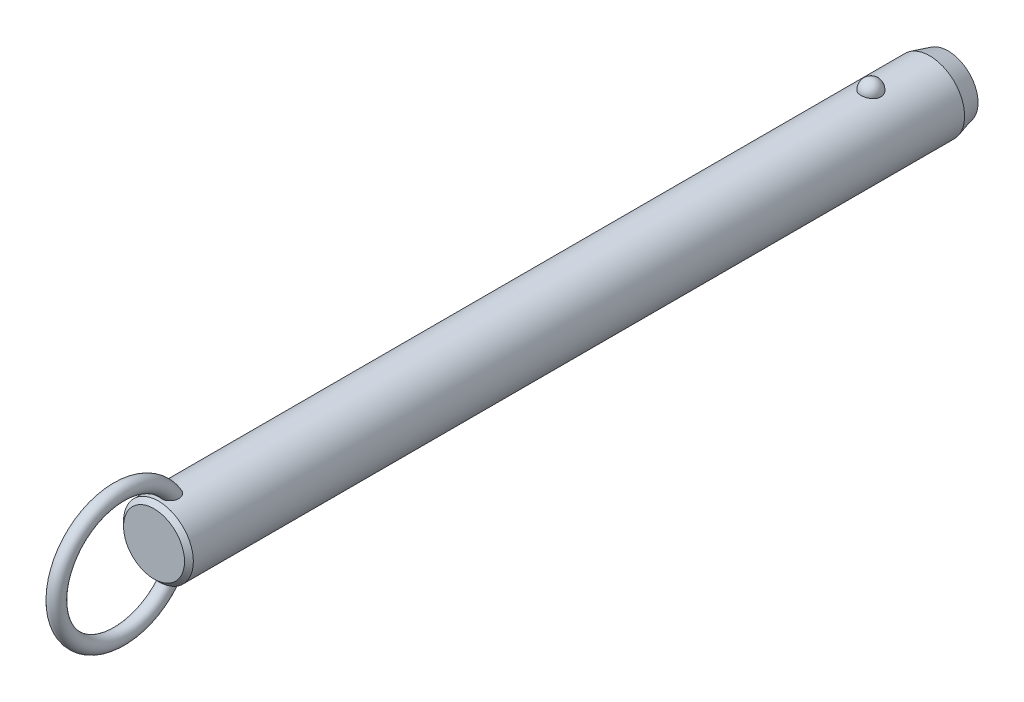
ISO-10303-21;
HEADER;
FILE_DESCRIPTION(('STEP AP214'),'2;1');
FILE_NAME('part.step','',(''),(''),'','','');
FILE_SCHEMA(('AUTOMOTIVE_DESIGN { 1 0 10303 214 1 1 1 1 }'));
ENDSEC;
DATA;
#1=APPLICATION_CONTEXT('core data for automotive mechanical design processes');
#2=APPLICATION_PROTOCOL_DEFINITION('international standard','automotive_design',2000,#1);
#3=PRODUCT_CONTEXT('',#1,'mechanical');
#4=PRODUCT('Part','Part','',(#3));
#5=PRODUCT_RELATED_PRODUCT_CATEGORY('part','',(#4));
#6=PRODUCT_DEFINITION_FORMATION('','',#4);
#7=PRODUCT_DEFINITION_CONTEXT('part definition',#1,'design');
#8=PRODUCT_DEFINITION('design','',#6,#7);
#9=PRODUCT_DEFINITION_SHAPE('','',#8);
#10=(LENGTH_UNIT() NAMED_UNIT(*) SI_UNIT(.MILLI.,.METRE.));
#11=(NAMED_UNIT(*) PLANE_ANGLE_UNIT() SI_UNIT($,.RADIAN.));
#12=(NAMED_UNIT(*) SI_UNIT($,.STERADIAN.) SOLID_ANGLE_UNIT());
#13=UNCERTAINTY_MEASURE_WITH_UNIT(LENGTH_MEASURE(1.E-05),#10,'distance_accuracy_value','');
#14=(GEOMETRIC_REPRESENTATION_CONTEXT(3) GLOBAL_UNCERTAINTY_ASSIGNED_CONTEXT((#13)) GLOBAL_UNIT_ASSIGNED_CONTEXT((#10,
#11,#12)) REPRESENTATION_CONTEXT('',''));
#15=CARTESIAN_POINT('',(0.,0.,0.));
#16=DIRECTION('',(0.,0.,1.));
#17=DIRECTION('',(1.,0.,0.));
#18=AXIS2_PLACEMENT_3D('',#15,#16,#17);
#19=CARTESIAN_POINT('',(0.,0.,182.9));
#20=DIRECTION('',(0.,0.,-1.));
#21=DIRECTION('',(-1.,0.,0.));
#22=AXIS2_PLACEMENT_3D('',#19,#20,#21);
#23=CYLINDRICAL_SURFACE('',#22,9.5);
#24=CARTESIAN_POINT('',(2.67259918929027,9.11631578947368,-2.70000000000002));
#25=CARTESIAN_POINT('',(2.6725968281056,9.11631786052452,-2.54909854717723));
#26=CARTESIAN_POINT('',(2.66030567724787,9.11994722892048,-2.39816735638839));
#27=CARTESIAN_POINT('',(2.6114347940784,9.13405924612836,-2.10058568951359));
#28=CARTESIAN_POINT('',(2.57484658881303,9.14454428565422,-1.95393672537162));
#29=CARTESIAN_POINT('',(2.47830875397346,9.17117631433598,-1.66916069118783));
#30=CARTESIAN_POINT('',(2.41836936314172,9.18732082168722,-1.53102991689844));
#31=CARTESIAN_POINT('',(2.27661331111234,9.22346780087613,-1.26705393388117));
#32=CARTESIAN_POINT('',(2.19479699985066,9.24347021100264,-1.14120852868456));
#33=CARTESIAN_POINT('',(2.01085282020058,9.28522401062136,-0.904632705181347));
#34=CARTESIAN_POINT('',(1.90862396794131,9.30698376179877,-0.793982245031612));
#35=CARTESIAN_POINT('',(1.6867437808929,9.34973971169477,-0.591607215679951));
#36=CARTESIAN_POINT('',(1.56709244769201,9.37073591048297,-0.499882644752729));
#37=CARTESIAN_POINT('',(1.31393976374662,9.40956370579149,-0.33816762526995));
#38=CARTESIAN_POINT('',(1.18048026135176,9.42740444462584,-0.268113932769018));
#39=CARTESIAN_POINT('',(0.903154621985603,9.45799906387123,-0.151390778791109));
#40=CARTESIAN_POINT('',(0.759289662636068,9.47075351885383,-0.104718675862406));
#41=CARTESIAN_POINT('',(0.468074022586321,9.48956256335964,-0.0367633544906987));
#42=CARTESIAN_POINT('',(0.320836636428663,9.49573643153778,-0.015027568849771));
#43=CARTESIAN_POINT('',(0.0246714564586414,9.50112183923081,0.0039619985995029));
#44=CARTESIAN_POINT('',(-0.124256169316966,9.50033406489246,0.00121819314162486));
#45=CARTESIAN_POINT('',(-0.417264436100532,9.4919475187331,-0.0284441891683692));
#46=CARTESIAN_POINT('',(-0.56138413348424,9.48444885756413,-0.0550074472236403));
#47=CARTESIAN_POINT('',(-0.842986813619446,9.46357853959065,-0.131064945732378));
#48=CARTESIAN_POINT('',(-0.980469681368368,9.450206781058,-0.180559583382));
#49=CARTESIAN_POINT('',(-1.24585005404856,9.41890822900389,-0.301476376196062));
#50=CARTESIAN_POINT('',(-1.37368611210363,9.40095498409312,-0.373026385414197));
#51=CARTESIAN_POINT('',(-1.61552738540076,9.3624296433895,-0.53602540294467));
#52=CARTESIAN_POINT('',(-1.72953116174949,9.34185727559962,-0.62747647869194));
#53=CARTESIAN_POINT('',(-1.9429225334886,9.29984568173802,-0.829844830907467));
#54=CARTESIAN_POINT('',(-2.04198021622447,9.27839736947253,-0.941108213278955));
#55=CARTESIAN_POINT('',(-2.2202646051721,9.23735994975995,-1.17883414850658));
#56=CARTESIAN_POINT('',(-2.29948985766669,9.21777097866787,-1.30529781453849));
#57=CARTESIAN_POINT('',(-2.43697287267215,9.18238994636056,-1.57158566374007));
#58=CARTESIAN_POINT('',(-2.49497068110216,9.16664569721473,-1.71155057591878));
#59=CARTESIAN_POINT('',(-2.5872073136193,9.14104303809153,-1.99961197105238));
#60=CARTESIAN_POINT('',(-2.62144683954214,9.13118445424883,-2.1477082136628));
#61=CARTESIAN_POINT('',(-2.66521466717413,9.11850622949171,-2.44715424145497));
#62=CARTESIAN_POINT('',(-2.67484831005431,9.11565658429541,-2.59848735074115));
#63=CARTESIAN_POINT('',(-2.66946735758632,9.11723375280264,-2.90067317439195));
#64=CARTESIAN_POINT('',(-2.65445345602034,9.12166036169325,-3.05152590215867));
#65=CARTESIAN_POINT('',(-2.6002971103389,9.13724422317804,-3.34766110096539));
#66=CARTESIAN_POINT('',(-2.56127978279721,9.14836656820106,-3.49296833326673));
#67=CARTESIAN_POINT('',(-2.46018844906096,9.17606676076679,-3.77477535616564));
#68=CARTESIAN_POINT('',(-2.39811349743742,9.19264483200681,-3.91127478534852));
#69=CARTESIAN_POINT('',(-2.25202303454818,9.22952198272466,-4.17244273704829));
#70=CARTESIAN_POINT('',(-2.16788714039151,9.24984129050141,-4.29704106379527));
#71=CARTESIAN_POINT('',(-1.9799408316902,9.29188255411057,-4.53013066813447));
#72=CARTESIAN_POINT('',(-1.87612963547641,9.31360456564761,-4.63862130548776));
#73=CARTESIAN_POINT('',(-1.65105429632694,9.35612959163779,-4.83690299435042));
#74=CARTESIAN_POINT('',(-1.52972405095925,9.37692871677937,-4.9266199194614));
#75=CARTESIAN_POINT('',(-1.27318250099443,9.41518970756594,-5.08429106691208));
#76=CARTESIAN_POINT('',(-1.13797219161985,9.432651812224,-5.15224684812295));
#77=CARTESIAN_POINT('',(-0.859280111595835,9.46208255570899,-5.26371827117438));
#78=CARTESIAN_POINT('',(-0.715925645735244,9.47411833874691,-5.30753421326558));
#79=CARTESIAN_POINT('',(-0.423550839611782,9.4916822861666,-5.37076321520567));
#80=CARTESIAN_POINT('',(-0.2745312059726,9.49721125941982,-5.39017930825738));
#81=CARTESIAN_POINT('',(0.0218446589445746,9.50110860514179,-5.40390587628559));
#82=CARTESIAN_POINT('',(0.16917707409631,9.49961381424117,-5.39869609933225));
#83=CARTESIAN_POINT('',(0.460808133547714,9.48993906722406,-5.36441955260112));
#84=CARTESIAN_POINT('',(0.605106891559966,9.48175936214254,-5.33535367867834));
#85=CARTESIAN_POINT('',(0.886027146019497,9.4596376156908,-5.25435587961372));
#86=CARTESIAN_POINT('',(1.02267710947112,9.44571881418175,-5.20251612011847));
#87=CARTESIAN_POINT('',(1.28523827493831,9.41358993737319,-5.07741549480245));
#88=CARTESIAN_POINT('',(1.41114877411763,9.39537958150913,-5.00415322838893));
#89=CARTESIAN_POINT('',(1.65085227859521,9.3562644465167,-4.83684599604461));
#90=CARTESIAN_POINT('',(1.76442346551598,9.33532178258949,-4.74249218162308));
#91=CARTESIAN_POINT('',(1.97425672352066,9.29321198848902,-4.53620389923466));
#92=CARTESIAN_POINT('',(2.07051582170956,9.27204482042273,-4.42426641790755));
#93=CARTESIAN_POINT('',(2.24490086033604,9.23139221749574,-4.18363183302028));
#94=CARTESIAN_POINT('',(2.32267019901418,9.21194380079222,-4.05466990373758));
#95=CARTESIAN_POINT('',(2.45584092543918,9.1773419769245,-3.78517836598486));
#96=CARTESIAN_POINT('',(2.51124979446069,9.16218713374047,-3.644652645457));
#97=CARTESIAN_POINT('',(2.59380876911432,9.13913522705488,-3.37104301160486));
#98=CARTESIAN_POINT('',(2.62330266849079,9.13064624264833,-3.23871053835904));
#99=CARTESIAN_POINT('',(2.66269870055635,9.11923566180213,-2.97092664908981));
#100=CARTESIAN_POINT('',(2.67260130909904,9.11631393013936,-2.83547530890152));
#101=CARTESIAN_POINT('',(2.67259918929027,9.11631578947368,-2.70000000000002));
#102=B_SPLINE_CURVE_WITH_KNOTS('',3,(#24,#25,#26,#27,#28,#29,#30,#31,#32,#33,#34,#35,#36,#37,
#38,#39,#40,#41,#42,#43,#44,#45,#46,#47,#48,#49,#50,#51,#52,#53,#54,#55,#56,#57,#58,#59,#60,#61,
#62,#63,#64,#65,#66,#67,#68,#69,#70,#71,#72,#73,#74,#75,#76,#77,#78,#79,#80,#81,#82,#83,#84,#85,
#86,#87,#88,#89,#90,#91,#92,#93,#94,#95,#96,#97,#98,#99,#100,#101),.UNSPECIFIED.,.T.,.F.,(4,2,2,
2,2,2,2,2,2,2,2,2,2,2,2,2,2,2,2,2,2,2,2,2,2,2,2,2,2,2,2,2,2,2,2,2,2,2,4),(0.,0.452217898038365,
0.904593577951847,1.35677112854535,1.80894144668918,2.26340676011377,2.71787203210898,
3.17099820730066,3.62407318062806,4.0687883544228,4.51345969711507,4.95160616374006,
5.38976021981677,5.83050358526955,6.27129275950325,6.72071308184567,7.17016633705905,
7.62495278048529,8.07972578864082,8.53254856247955,8.98535859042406,9.43582813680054,
9.88631615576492,10.3393155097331,10.7923328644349,11.2471065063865,11.7018475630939,
12.150795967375,12.5996885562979,13.0398725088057,13.4800399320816,13.9184421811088,
14.3568730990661,14.802202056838,15.2476074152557,15.7010097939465,16.1542603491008,
16.5602594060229,16.9662486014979),.UNSPECIFIED.);
#103=CARTESIAN_POINT('',(2.67259918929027,9.11631578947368,-2.70000000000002));
#104=VERTEX_POINT('',#103);
#105=EDGE_CURVE('E41',#104,#104,#102,.T.);
#106=ORIENTED_EDGE('',*,*,#105,.T.);
#107=EDGE_LOOP('',(#106));
#108=FACE_BOUND('',#107,.T.);
#109=CARTESIAN_POINT('',(0.,0.,191.22));
#110=DIRECTION('',(0.,0.,1.));
#111=DIRECTION('',(1.,0.,0.));
#112=AXIS2_PLACEMENT_3D('',#109,#110,#111);
#113=CIRCLE('',#112,9.5);
#114=CARTESIAN_POINT('',(9.5,0.,191.22));
#115=VERTEX_POINT('',#114);
#116=EDGE_CURVE('E10',#115,#115,#113,.F.);
#117=ORIENTED_EDGE('',*,*,#116,.T.);
#118=EDGE_LOOP('',(#117));
#119=FACE_BOUND('',#118,.T.);
#120=CARTESIAN_POINT('',(-0.697062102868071,-9.47439269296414,185.567808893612));
#121=CARTESIAN_POINT('',(-0.799579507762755,-9.46685146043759,185.607482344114));
#122=CARTESIAN_POINT('',(-0.898575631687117,-9.45788043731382,185.6559309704));
#123=CARTESIAN_POINT('',(-1.08670047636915,-9.43811593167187,185.768868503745));
#124=CARTESIAN_POINT('',(-1.17583204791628,-9.42732297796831,185.833352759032));
#125=CARTESIAN_POINT('',(-1.34179806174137,-9.40513672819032,185.976209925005));
#126=CARTESIAN_POINT('',(-1.41865133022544,-9.39374438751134,186.054561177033));
#127=CARTESIAN_POINT('',(-1.55860047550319,-9.37154196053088,186.222752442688));
#128=CARTESIAN_POINT('',(-1.62169476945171,-9.3607319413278,186.31259377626));
#129=CARTESIAN_POINT('',(-1.73527695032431,-9.34035749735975,186.504500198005));
#130=CARTESIAN_POINT('',(-1.78522266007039,-9.33085270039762,186.606891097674));
#131=CARTESIAN_POINT('',(-1.86924997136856,-9.3143834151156,186.818148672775));
#132=CARTESIAN_POINT('',(-1.90332570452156,-9.30741986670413,186.927017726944));
#133=CARTESIAN_POINT('',(-1.95893603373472,-9.29588482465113,187.160473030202));
#134=CARTESIAN_POINT('',(-1.97872420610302,-9.29165182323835,187.285489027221));
#135=CARTESIAN_POINT('',(-2.00062129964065,-9.28695978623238,187.537080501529));
#136=CARTESIAN_POINT('',(-2.00272284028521,-9.28650232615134,187.663656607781));
#137=CARTESIAN_POINT('',(-1.98958876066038,-9.28932750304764,187.936815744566));
#138=CARTESIAN_POINT('',(-1.97143366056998,-9.2932400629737,188.083251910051));
#139=CARTESIAN_POINT('',(-1.91479925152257,-9.30507151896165,188.372062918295));
#140=CARTESIAN_POINT('',(-1.87629122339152,-9.31299607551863,188.514431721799));
#141=CARTESIAN_POINT('',(-1.77225683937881,-9.33340232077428,188.815172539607));
#142=CARTESIAN_POINT('',(-1.70334898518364,-9.34641636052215,188.972369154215));
#143=CARTESIAN_POINT('',(-1.58111062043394,-9.36759153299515,189.197517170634));
#144=CARTESIAN_POINT('',(-1.53721459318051,-9.37492619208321,189.270796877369));
#145=CARTESIAN_POINT('',(-1.4430263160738,-9.38988566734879,189.41307405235));
#146=CARTESIAN_POINT('',(-1.39273721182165,-9.39751033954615,189.482073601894));
#147=CARTESIAN_POINT('',(-1.26775962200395,-9.41530678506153,189.636983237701));
#148=CARTESIAN_POINT('',(-1.19052326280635,-9.42548108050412,189.720871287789));
#149=CARTESIAN_POINT('',(-1.02420241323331,-9.44499825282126,189.876008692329));
#150=CARTESIAN_POINT('',(-0.93513986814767,-9.45434261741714,189.947280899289));
#151=CARTESIAN_POINT('',(-0.766610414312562,-9.46930670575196,190.058695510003));
#152=CARTESIAN_POINT('',(-0.689439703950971,-9.47529223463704,190.102235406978));
#153=CARTESIAN_POINT('',(-0.528942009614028,-9.48560294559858,190.17631336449));
#154=CARTESIAN_POINT('',(-0.445620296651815,-9.48992953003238,190.206862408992));
#155=CARTESIAN_POINT('',(-0.273901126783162,-9.49644161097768,190.252579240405));
#156=CARTESIAN_POINT('',(-0.18546574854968,-9.49860811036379,190.26761059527));
#157=CARTESIAN_POINT('',(-0.00734541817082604,-9.5004135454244,190.280149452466));
#158=CARTESIAN_POINT('',(0.0823387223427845,-9.50005405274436,190.277667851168));
#159=CARTESIAN_POINT('',(0.24767927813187,-9.49708301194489,190.256995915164));
#160=CARTESIAN_POINT('',(0.323620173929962,-9.49477609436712,190.240930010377));
#161=CARTESIAN_POINT('',(0.471981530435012,-9.48855917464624,190.197172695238));
#162=CARTESIAN_POINT('',(0.544400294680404,-9.48464840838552,190.169475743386));
#163=CARTESIAN_POINT('',(0.708947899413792,-9.47398336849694,190.09280266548));
#164=CARTESIAN_POINT('',(0.799149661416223,-9.46671310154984,190.039774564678));
#165=CARTESIAN_POINT('',(0.969783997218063,-9.45076225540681,189.919973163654));
#166=CARTESIAN_POINT('',(1.050194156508,-9.44207854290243,189.853169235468));
#167=CARTESIAN_POINT('',(1.2309234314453,-9.42051459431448,189.680759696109));
#168=CARTESIAN_POINT('',(1.32652499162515,-9.40733378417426,189.57026193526));
#169=CARTESIAN_POINT('',(1.49893121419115,-9.38140745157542,189.335561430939));
#170=CARTESIAN_POINT('',(1.5757161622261,-9.36866239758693,189.211344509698));
#171=CARTESIAN_POINT('',(1.71285426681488,-9.34457644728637,188.949389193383));
#172=CARTESIAN_POINT('',(1.77266365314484,-9.33328726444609,188.81136233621));
#173=CARTESIAN_POINT('',(1.87239208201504,-9.31379209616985,188.528051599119));
#174=CARTESIAN_POINT('',(1.91230158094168,-9.3055875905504,188.382764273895));
#175=CARTESIAN_POINT('',(1.97604189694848,-9.29228394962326,188.062028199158));
#176=CARTESIAN_POINT('',(1.9958743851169,-9.28797202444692,187.885724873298));
#177=CARTESIAN_POINT('',(2.0029570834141,-9.28645519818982,187.532414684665));
#178=CARTESIAN_POINT('',(1.99025930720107,-9.28923895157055,187.355409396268));
#179=CARTESIAN_POINT('',(1.93735479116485,-9.30038134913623,187.056338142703));
#180=CARTESIAN_POINT('',(1.90576827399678,-9.30697680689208,186.932667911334));
#181=CARTESIAN_POINT('',(1.8228748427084,-9.32356855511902,186.692329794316));
#182=CARTESIAN_POINT('',(1.77158213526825,-9.33356239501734,186.575656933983));
#183=CARTESIAN_POINT('',(1.64885744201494,-9.35602275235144,186.352706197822));
#184=CARTESIAN_POINT('',(1.57730995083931,-9.36850332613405,186.246492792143));
#185=CARTESIAN_POINT('',(1.41543264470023,-9.39431873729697,186.049553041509));
#186=CARTESIAN_POINT('',(1.32510883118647,-9.40765330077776,185.958821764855));
#187=CARTESIAN_POINT('',(1.13846223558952,-9.43195720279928,185.805033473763));
#188=CARTESIAN_POINT('',(1.04369890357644,-9.44302894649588,185.740094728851));
#189=CARTESIAN_POINT('',(0.843965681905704,-9.46296805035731,185.628038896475));
#190=CARTESIAN_POINT('',(0.739000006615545,-9.47183631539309,185.580914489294));
#191=CARTESIAN_POINT('',(0.528175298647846,-9.48586140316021,185.508117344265));
#192=CARTESIAN_POINT('',(0.422686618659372,-9.49119633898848,185.48140249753));
#193=CARTESIAN_POINT('',(0.208590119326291,-9.49831365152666,185.446013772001));
#194=CARTESIAN_POINT('',(0.0999817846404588,-9.500095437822,185.437342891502));
#195=CARTESIAN_POINT('',(-0.126104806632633,-9.49988861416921,185.438350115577));
#196=CARTESIAN_POINT('',(-0.243578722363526,-9.49757821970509,185.449594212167));
#197=CARTESIAN_POINT('',(-0.474390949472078,-9.48885165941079,185.493167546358));
#198=CARTESIAN_POINT('',(-0.587729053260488,-9.48243528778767,185.525497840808));
#199=CARTESIAN_POINT('',(-0.697062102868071,-9.47439269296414,185.567808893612));
#200=B_SPLINE_CURVE_WITH_KNOTS('',3,(#120,#121,#122,#123,#124,#125,#126,#127,#128,#129,#130,
#131,#132,#133,#134,#135,#136,#137,#138,#139,#140,#141,#142,#143,#144,#145,#146,#147,#148,#149,
#150,#151,#152,#153,#154,#155,#156,#157,#158,#159,#160,#161,#162,#163,#164,#165,#166,#167,#168,
#169,#170,#171,#172,#173,#174,#175,#176,#177,#178,#179,#180,#181,#182,#183,#184,#185,#186,#187,
#188,#189,#190,#191,#192,#193,#194,#195,#196,#197,#198,#199),.UNSPECIFIED.,.T.,.F.,(4,2,2,2,2,2,
2,2,2,2,2,2,2,2,2,2,2,2,2,2,2,2,2,2,2,2,2,2,2,2,2,2,2,2,2,2,2,2,2,4),(0.,0.330119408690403,
0.660143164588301,0.989655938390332,1.31920659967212,1.66074728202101,2.00241415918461,
2.38088696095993,2.75951768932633,3.20065679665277,3.64242004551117,4.15620996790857,
4.4131416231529,4.66994734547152,5.01228664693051,5.35399933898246,5.61943037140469,
5.88463652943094,6.15215502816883,6.4195070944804,6.65144391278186,6.88349136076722,
7.19641200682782,7.51003602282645,7.94779711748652,8.3860149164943,8.83699707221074,
9.28819530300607,9.81778662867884,10.34653170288,10.7284172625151,11.1100280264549,
11.4938603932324,11.8775702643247,12.2220189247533,12.5663259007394,12.8915939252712,
13.2169159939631,13.5689650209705,13.9210316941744),.UNSPECIFIED.);
#201=CARTESIAN_POINT('',(-0.697062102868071,-9.47439269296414,185.567808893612));
#202=VERTEX_POINT('',#201);
#203=EDGE_CURVE('E59',#202,#202,#200,.T.);
#204=ORIENTED_EDGE('',*,*,#203,.T.);
#205=EDGE_LOOP('',(#204));
#206=FACE_BOUND('',#205,.T.);
#207=CARTESIAN_POINT('',(-0.697062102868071,9.47439269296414,185.567808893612));
#208=CARTESIAN_POINT('',(-0.597792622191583,9.48169483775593,185.52939564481));
#209=CARTESIAN_POINT('',(-0.495106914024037,9.48766580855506,185.499168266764));
#210=CARTESIAN_POINT('',(-0.285876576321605,9.49627648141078,185.456032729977));
#211=CARTESIAN_POINT('',(-0.179324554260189,9.49890941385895,185.443159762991));
#212=CARTESIAN_POINT('',(0.0344157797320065,9.50053798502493,185.435166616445));
#213=CARTESIAN_POINT('',(0.141603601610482,9.49953613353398,185.440034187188));
#214=CARTESIAN_POINT('',(0.35356357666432,9.49401038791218,185.467365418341));
#215=CARTESIAN_POINT('',(0.458336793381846,9.48948807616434,185.48982117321));
#216=CARTESIAN_POINT('',(0.662493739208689,9.4774236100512,185.551671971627));
#217=CARTESIAN_POINT('',(0.761881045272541,9.46988348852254,185.591055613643));
#218=CARTESIAN_POINT('',(0.95260839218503,9.45260382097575,185.685634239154));
#219=CARTESIAN_POINT('',(1.04394806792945,9.44286417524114,185.740829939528));
#220=CARTESIAN_POINT('',(1.21712767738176,9.42211760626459,185.866066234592));
#221=CARTESIAN_POINT('',(1.29885671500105,9.41109835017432,185.936257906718));
#222=CARTESIAN_POINT('',(1.44978975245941,9.38903310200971,186.088980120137));
#223=CARTESIAN_POINT('',(1.51899278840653,9.37798710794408,186.171511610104));
#224=CARTESIAN_POINT('',(1.64602857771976,9.35654375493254,186.349776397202));
#225=CARTESIAN_POINT('',(1.70333052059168,9.34618688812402,186.445891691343));
#226=CARTESIAN_POINT('',(1.80259341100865,9.32755128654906,186.645897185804));
#227=CARTESIAN_POINT('',(1.84454942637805,9.31927322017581,186.749789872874));
#228=CARTESIAN_POINT('',(1.91637039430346,9.30478365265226,186.972213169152));
#229=CARTESIAN_POINT('',(1.944805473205,9.29882552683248,187.091219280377));
#230=CARTESIAN_POINT('',(1.98449865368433,9.29043398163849,187.332143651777));
#231=CARTESIAN_POINT('',(1.99574908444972,9.28800213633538,187.454063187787));
#232=CARTESIAN_POINT('',(2.00275141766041,9.28649645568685,187.716932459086));
#233=CARTESIAN_POINT('',(1.99588238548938,9.28799035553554,187.857952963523));
#234=CARTESIAN_POINT('',(1.96270559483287,9.29505517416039,188.137621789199));
#235=CARTESIAN_POINT('',(1.93637872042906,9.30063010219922,188.276267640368));
#236=CARTESIAN_POINT('',(1.85949176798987,9.31633564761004,188.572561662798));
#237=CARTESIAN_POINT('',(1.80549792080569,9.3270926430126,188.729290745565));
#238=CARTESIAN_POINT('',(1.67376869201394,9.3516306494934,189.032284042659));
#239=CARTESIAN_POINT('',(1.59603181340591,9.36541185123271,189.178547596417));
#240=CARTESIAN_POINT('',(1.4360277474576,9.39110706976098,189.425813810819));
#241=CARTESIAN_POINT('',(1.35831795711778,9.40278656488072,189.529791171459));
#242=CARTESIAN_POINT('',(1.18774483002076,9.42585025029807,189.724534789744));
#243=CARTESIAN_POINT('',(1.09490932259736,9.43723493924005,189.815324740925));
#244=CARTESIAN_POINT('',(0.92111037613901,9.45552616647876,189.95620334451));
#245=CARTESIAN_POINT('',(0.84373824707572,9.46281058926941,190.010656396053));
#246=CARTESIAN_POINT('',(0.681245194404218,9.47589120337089,190.106711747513));
#247=CARTESIAN_POINT('',(0.596135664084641,9.48168953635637,190.148332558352));
#248=CARTESIAN_POINT('',(0.433779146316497,9.49038144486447,190.210089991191));
#249=CARTESIAN_POINT('',(0.357459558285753,9.49359170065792,190.23260136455));
#250=CARTESIAN_POINT('',(0.202074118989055,9.49816761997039,190.264574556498));
#251=CARTESIAN_POINT('',(0.123010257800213,9.49953459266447,190.274045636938));
#252=CARTESIAN_POINT('',(-0.03573724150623,9.50026497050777,190.279114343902));
#253=CARTESIAN_POINT('',(-0.115421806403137,9.49962433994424,190.274684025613));
#254=CARTESIAN_POINT('',(-0.272823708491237,9.49640854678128,190.252296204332));
#255=CARTESIAN_POINT('',(-0.350540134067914,9.4938325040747,190.234332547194));
#256=CARTESIAN_POINT('',(-0.500580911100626,9.48709462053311,190.186802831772));
#257=CARTESIAN_POINT('',(-0.572979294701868,9.48296359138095,190.157461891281));
#258=CARTESIAN_POINT('',(-0.712864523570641,9.47347609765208,190.089008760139));
#259=CARTESIAN_POINT('',(-0.780349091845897,9.46811906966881,190.049892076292));
#260=CARTESIAN_POINT('',(-0.946309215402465,9.45329720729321,189.939432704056));
#261=CARTESIAN_POINT('',(-1.04090230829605,9.44321512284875,189.862329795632));
#262=CARTESIAN_POINT('',(-1.21661929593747,9.42219227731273,189.69409718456));
#263=CARTESIAN_POINT('',(-1.29770519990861,9.41124921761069,189.602929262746));
#264=CARTESIAN_POINT('',(-1.47319646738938,9.38563439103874,189.376162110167));
#265=CARTESIAN_POINT('',(-1.56208878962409,9.37102009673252,189.236289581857));
#266=CARTESIAN_POINT('',(-1.71623987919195,9.34401559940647,188.943950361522));
#267=CARTESIAN_POINT('',(-1.78147866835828,9.33162728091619,188.791473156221));
#268=CARTESIAN_POINT('',(-1.88853837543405,9.31055541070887,188.475647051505));
#269=CARTESIAN_POINT('',(-1.92998995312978,9.30193076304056,188.312168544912));
#270=CARTESIAN_POINT('',(-1.98590726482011,9.29015757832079,187.980526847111));
#271=CARTESIAN_POINT('',(-2.0004070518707,9.2870021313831,187.812369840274));
#272=CARTESIAN_POINT('',(-1.99964701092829,9.28716218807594,187.505080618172));
#273=CARTESIAN_POINT('',(-1.98908145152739,9.28945704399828,187.365936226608));
#274=CARTESIAN_POINT('',(-1.94566294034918,9.29865169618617,187.091153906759));
#275=CARTESIAN_POINT('',(-1.9128206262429,9.30554929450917,186.955514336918));
#276=CARTESIAN_POINT('',(-1.84582133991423,9.31898248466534,186.757802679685));
#277=CARTESIAN_POINT('',(-1.82038084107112,9.32400364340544,186.692583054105));
#278=CARTESIAN_POINT('',(-1.76350511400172,9.33492884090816,186.564903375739));
#279=CARTESIAN_POINT('',(-1.73207305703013,9.34083241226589,186.502441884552));
#280=CARTESIAN_POINT('',(-1.66324243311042,9.35333332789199,186.38094078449));
#281=CARTESIAN_POINT('',(-1.62584239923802,9.35993084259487,186.321902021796));
#282=CARTESIAN_POINT('',(-1.54527678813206,9.37356864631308,186.207987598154));
#283=CARTESIAN_POINT('',(-1.50211241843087,9.38060884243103,186.153111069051));
#284=CARTESIAN_POINT('',(-1.37681147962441,9.40004442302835,186.009961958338));
#285=CARTESIAN_POINT('',(-1.28916358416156,9.41261047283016,185.926429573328));
#286=CARTESIAN_POINT('',(-1.09996826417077,9.43658180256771,185.777236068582));
#287=CARTESIAN_POINT('',(-0.998461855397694,9.44799034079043,185.711523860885));
#288=CARTESIAN_POINT('',(-0.860188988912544,9.46103017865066,185.6394367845));
#289=CARTESIAN_POINT('',(-0.828141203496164,9.46389141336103,185.623851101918));
#290=CARTESIAN_POINT('',(-0.763210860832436,9.46934915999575,185.594473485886));
#291=CARTESIAN_POINT('',(-0.730328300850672,9.47194567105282,185.580681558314));
#292=CARTESIAN_POINT('',(-0.697062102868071,9.47439269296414,185.567808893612));
#293=B_SPLINE_CURVE_WITH_KNOTS('',3,(#207,#208,#209,#210,#211,#212,#213,#214,#215,#216,#217,
#218,#219,#220,#221,#222,#223,#224,#225,#226,#227,#228,#229,#230,#231,#232,#233,#234,#235,#236,
#237,#238,#239,#240,#241,#242,#243,#244,#245,#246,#247,#248,#249,#250,#251,#252,#253,#254,#255,
#256,#257,#258,#259,#260,#261,#262,#263,#264,#265,#266,#267,#268,#269,#270,#271,#272,#273,#274,
#275,#276,#277,#278,#279,#280,#281,#282,#283,#284,#285,#286,#287,#288,#289,#290,#291,#292),
.UNSPECIFIED.,.T.,.F.,(4,2,2,2,2,2,2,2,2,2,2,2,2,2,2,2,2,2,2,2,2,2,2,2,2,2,2,2,2,2,2,2,2,2,2,2,
2,2,2,2,2,2,4),(0.,0.319942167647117,0.640532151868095,0.96090081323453,1.2811255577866,
1.60113495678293,1.92115886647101,2.24457323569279,2.56801248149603,2.90371927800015,
3.23953387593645,3.60560313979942,3.97183576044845,4.39383693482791,4.8162532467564,
5.31257045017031,5.80891895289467,6.19868344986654,6.58773876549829,6.87145417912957,
7.15475838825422,7.39263751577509,7.63034760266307,7.86853584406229,8.10683246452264,
8.3406366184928,8.57454843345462,8.93983939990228,9.30614105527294,9.80266668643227,
10.2996107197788,10.8040753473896,11.3079021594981,11.7249776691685,12.1418541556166,
12.3521485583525,12.5623319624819,12.7725671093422,12.9827582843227,13.345827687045,
13.7078449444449,13.8150604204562,13.9222762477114),.UNSPECIFIED.);
#294=CARTESIAN_POINT('',(-0.697062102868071,9.47439269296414,185.567808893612));
#295=VERTEX_POINT('',#294);
#296=EDGE_CURVE('E66',#295,#295,#293,.T.);
#297=ORIENTED_EDGE('',*,*,#296,.T.);
#298=EDGE_LOOP('',(#297));
#299=FACE_BOUND('',#298,.T.);
#300=CARTESIAN_POINT('',(0.,0.,-18.6999999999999));
#301=DIRECTION('',(0.,0.,-1.));
#302=DIRECTION('',(-1.,0.,0.));
#303=AXIS2_PLACEMENT_3D('',#300,#301,#302);
#304=CIRCLE('',#303,9.5);
#305=CARTESIAN_POINT('',(-9.5,0.,-18.6999999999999));
#306=VERTEX_POINT('',#305);
#307=EDGE_CURVE('E56',#306,#306,#304,.F.);
#308=ORIENTED_EDGE('',*,*,#307,.T.);
#309=EDGE_LOOP('',(#308));
#310=FACE_BOUND('',#309,.T.);
#311=ADVANCED_FACE('F37',(#108,#119,#206,#299,#310),#23,.T.);
#312=CARTESIAN_POINT('',(0.,0.,-23.7));
#313=DIRECTION('',(0.,0.,-1.));
#314=DIRECTION('',(-1.,0.,0.));
#315=AXIS2_PLACEMENT_3D('',#312,#313,#314);
#316=PLANE('',#315);
#317=CARTESIAN_POINT('',(0.,0.,-23.7));
#318=DIRECTION('',(0.,0.,-1.));
#319=DIRECTION('',(-1.,0.,0.));
#320=AXIS2_PLACEMENT_3D('',#317,#318,#319);
#321=CIRCLE('',#320,8.16025403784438);
#322=CARTESIAN_POINT('',(-8.16025403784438,0.,-23.7));
#323=VERTEX_POINT('',#322);
#324=EDGE_CURVE('E65',#323,#323,#321,.T.);
#325=ORIENTED_EDGE('',*,*,#324,.T.);
#326=EDGE_LOOP('',(#325));
#327=FACE_BOUND('',#326,.T.);
#328=ADVANCED_FACE('F84',(#327),#316,.T.);
#329=CARTESIAN_POINT('',(0.,0.,-23.7));
#330=DIRECTION('',(0.,0.,1.));
#331=DIRECTION('',(1.,0.,0.));
#332=AXIS2_PLACEMENT_3D('',#329,#330,#331);
#333=CONICAL_SURFACE('',#332,8.16025403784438,0.261799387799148);
#334=ORIENTED_EDGE('',*,*,#307,.F.);
#335=EDGE_LOOP('',(#334));
#336=FACE_BOUND('',#335,.T.);
#337=ORIENTED_EDGE('',*,*,#324,.F.);
#338=EDGE_LOOP('',(#337));
#339=FACE_BOUND('',#338,.T.);
#340=ADVANCED_FACE('F82',(#336,#339),#333,.T.);
#341=CARTESIAN_POINT('',(0.,0.,192.42));
#342=DIRECTION('',(0.,0.,1.));
#343=DIRECTION('',(1.,0.,0.));
#344=AXIS2_PLACEMENT_3D('',#341,#342,#343);
#345=PLANE('',#344);
#346=CARTESIAN_POINT('',(0.,0.,192.42));
#347=DIRECTION('',(0.,0.,1.));
#348=DIRECTION('',(1.,0.,0.));
#349=AXIS2_PLACEMENT_3D('',#346,#347,#348);
#350=CIRCLE('',#349,8.3);
#351=CARTESIAN_POINT('',(8.3,0.,192.42));
#352=VERTEX_POINT('',#351);
#353=EDGE_CURVE('E50',#352,#352,#350,.T.);
#354=ORIENTED_EDGE('',*,*,#353,.T.);
#355=EDGE_LOOP('',(#354));
#356=FACE_BOUND('',#355,.T.);
#357=ADVANCED_FACE('F76',(#356),#345,.T.);
#358=CARTESIAN_POINT('',(0.,0.,201.95));
#359=DIRECTION('',(1.,0.,0.));
#360=DIRECTION('',(0.,0.,-1.));
#361=AXIS2_PLACEMENT_3D('',#358,#359,#360);
#362=TOROIDAL_SURFACE('',#361,17.05,2.);
#363=ORIENTED_EDGE('',*,*,#296,.F.);
#364=EDGE_LOOP('',(#363));
#365=FACE_BOUND('',#364,.T.);
#366=ORIENTED_EDGE('',*,*,#203,.F.);
#367=EDGE_LOOP('',(#366));
#368=FACE_BOUND('',#367,.T.);
#369=ADVANCED_FACE('F72',(#365,#368),#362,.T.);
#370=CARTESIAN_POINT('',(0.,0.,192.42));
#371=DIRECTION('',(0.,0.,-1.));
#372=DIRECTION('',(-1.,0.,0.));
#373=AXIS2_PLACEMENT_3D('',#370,#371,#372);
#374=CONICAL_SURFACE('',#373,8.3,0.785398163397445);
#375=ORIENTED_EDGE('',*,*,#116,.F.);
#376=EDGE_LOOP('',(#375));
#377=FACE_BOUND('',#376,.T.);
#378=ORIENTED_EDGE('',*,*,#353,.F.);
#379=EDGE_LOOP('',(#378));
#380=FACE_BOUND('',#379,.T.);
#381=ADVANCED_FACE('F39',(#377,#380),#374,.T.);
#382=CARTESIAN_POINT('',(0.,9.5,-2.70000000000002));
#383=DIRECTION('',(0.,1.,0.));
#384=DIRECTION('',(0.,0.,-1.));
#385=AXIS2_PLACEMENT_3D('',#382,#383,#384);
#386=SPHERICAL_SURFACE('',#385,2.7);
#387=ORIENTED_EDGE('',*,*,#105,.F.);
#388=EDGE_LOOP('',(#387));
#389=FACE_BOUND('',#388,.T.);
#390=ADVANCED_FACE('F78',(#389),#386,.T.);
#391=CLOSED_SHELL('',(#311,#328,#340,#357,#369,#381,#390));
#392=MANIFOLD_SOLID_BREP('B2',#391);
#393=ADVANCED_BREP_SHAPE_REPRESENTATION('',(#18,#392),#14);
#394=SHAPE_DEFINITION_REPRESENTATION(#9,#393);
ENDSEC;
END-ISO-10303-21;
